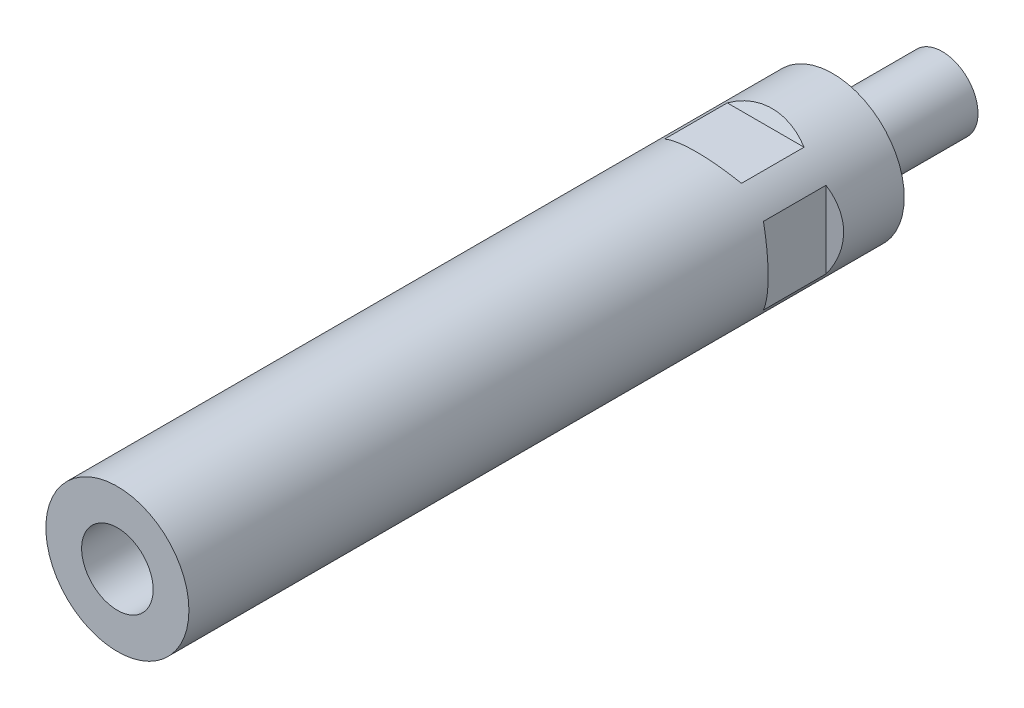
ISO-10303-21;
HEADER;
FILE_DESCRIPTION(('STEP AP214'),'2;1');
FILE_NAME('part.step','',(''),(''),'','','');
FILE_SCHEMA(('AUTOMOTIVE_DESIGN { 1 0 10303 214 1 1 1 1 }'));
ENDSEC;
DATA;
#1=APPLICATION_CONTEXT('core data for automotive mechanical design processes');
#2=APPLICATION_PROTOCOL_DEFINITION('international standard','automotive_design',2000,#1);
#3=PRODUCT_CONTEXT('',#1,'mechanical');
#4=PRODUCT('Part','Part','',(#3));
#5=PRODUCT_RELATED_PRODUCT_CATEGORY('part','',(#4));
#6=PRODUCT_DEFINITION_FORMATION('','',#4);
#7=PRODUCT_DEFINITION_CONTEXT('part definition',#1,'design');
#8=PRODUCT_DEFINITION('design','',#6,#7);
#9=PRODUCT_DEFINITION_SHAPE('','',#8);
#10=(LENGTH_UNIT() NAMED_UNIT(*) SI_UNIT(.MILLI.,.METRE.));
#11=(NAMED_UNIT(*) PLANE_ANGLE_UNIT() SI_UNIT($,.RADIAN.));
#12=(NAMED_UNIT(*) SI_UNIT($,.STERADIAN.) SOLID_ANGLE_UNIT());
#13=UNCERTAINTY_MEASURE_WITH_UNIT(LENGTH_MEASURE(1.E-05),#10,'distance_accuracy_value','');
#14=(GEOMETRIC_REPRESENTATION_CONTEXT(3) GLOBAL_UNCERTAINTY_ASSIGNED_CONTEXT((#13)) GLOBAL_UNIT_ASSIGNED_CONTEXT((#10,
#11,#12)) REPRESENTATION_CONTEXT('',''));
#15=CARTESIAN_POINT('',(0.,0.,0.));
#16=DIRECTION('',(0.,0.,1.));
#17=DIRECTION('',(1.,0.,0.));
#18=AXIS2_PLACEMENT_3D('',#15,#16,#17);
#19=CARTESIAN_POINT('',(0.,0.,-4.5));
#20=DIRECTION('',(0.,0.,1.));
#21=DIRECTION('',(0.,-1.,0.));
#22=AXIS2_PLACEMENT_3D('',#19,#20,#21);
#23=CYLINDRICAL_SURFACE('',#22,8.);
#24=CARTESIAN_POINT('',(0.,0.,-24.5));
#25=DIRECTION('',(0.,0.,1.));
#26=DIRECTION('',(0.,-1.,0.));
#27=AXIS2_PLACEMENT_3D('',#24,#25,#26);
#28=CIRCLE('',#27,8.);
#29=CARTESIAN_POINT('',(0.,-8.,-24.5));
#30=VERTEX_POINT('',#29);
#31=EDGE_CURVE('E22',#30,#30,#28,.F.);
#32=ORIENTED_EDGE('',*,*,#31,.F.);
#33=EDGE_LOOP('',(#32));
#34=FACE_BOUND('',#33,.T.);
#35=CARTESIAN_POINT('',(0.,0.,0.));
#36=DIRECTION('',(0.,0.,1.));
#37=DIRECTION('',(1.,0.,0.));
#38=AXIS2_PLACEMENT_3D('',#35,#36,#37);
#39=CIRCLE('',#38,8.);
#40=CARTESIAN_POINT('',(8.,0.,0.));
#41=VERTEX_POINT('',#40);
#42=EDGE_CURVE('E9',#41,#41,#39,.T.);
#43=ORIENTED_EDGE('',*,*,#42,.F.);
#44=EDGE_LOOP('',(#43));
#45=FACE_BOUND('',#44,.T.);
#46=ADVANCED_FACE('F14',(#34,#45),#23,.T.);
#47=CARTESIAN_POINT('',(0.,0.,-24.5));
#48=DIRECTION('',(0.,0.,1.));
#49=DIRECTION('',(0.,-1.,0.));
#50=AXIS2_PLACEMENT_3D('',#47,#48,#49);
#51=PLANE('',#50);
#52=ORIENTED_EDGE('',*,*,#31,.T.);
#53=EDGE_LOOP('',(#52));
#54=FACE_BOUND('',#53,.T.);
#55=ADVANCED_FACE('F16',(#54),#51,.F.);
#56=CARTESIAN_POINT('',(7.,0.,120.));
#57=DIRECTION('',(0.,0.,-1.));
#58=DIRECTION('',(-1.,0.,0.));
#59=AXIS2_PLACEMENT_3D('',#56,#57,#58);
#60=PLANE('',#59);
#61=CARTESIAN_POINT('',(0.,0.,120.));
#62=DIRECTION('',(0.,0.,1.));
#63=DIRECTION('',(1.,0.,0.));
#64=AXIS2_PLACEMENT_3D('',#61,#62,#63);
#65=CIRCLE('',#64,8.);
#66=CARTESIAN_POINT('',(8.,0.,120.));
#67=VERTEX_POINT('',#66);
#68=EDGE_CURVE('E251',#67,#67,#65,.T.);
#69=ORIENTED_EDGE('',*,*,#68,.T.);
#70=EDGE_LOOP('',(#69));
#71=FACE_BOUND('',#70,.T.);
#72=ADVANCED_FACE('F125',(#71),#60,.F.);
#73=CARTESIAN_POINT('',(0.,0.,160.));
#74=DIRECTION('',(0.,0.,1.));
#75=DIRECTION('',(1.,0.,0.));
#76=AXIS2_PLACEMENT_3D('',#73,#74,#75);
#77=CYLINDRICAL_SURFACE('',#76,8.);
#78=ORIENTED_EDGE('',*,*,#68,.F.);
#79=EDGE_LOOP('',(#78));
#80=FACE_BOUND('',#79,.T.);
#81=CARTESIAN_POINT('',(0.,0.,160.));
#82=DIRECTION('',(0.,0.,1.));
#83=DIRECTION('',(1.,0.,0.));
#84=AXIS2_PLACEMENT_3D('',#81,#82,#83);
#85=CIRCLE('',#84,8.);
#86=CARTESIAN_POINT('',(8.,0.,160.));
#87=VERTEX_POINT('',#86);
#88=EDGE_CURVE('E96',#87,#87,#85,.T.);
#89=ORIENTED_EDGE('',*,*,#88,.T.);
#90=EDGE_LOOP('',(#89));
#91=FACE_BOUND('',#90,.T.);
#92=ADVANCED_FACE('F127',(#80,#91),#77,.F.);
#93=CARTESIAN_POINT('',(0.,0.,160.));
#94=DIRECTION('',(0.,0.,1.));
#95=DIRECTION('',(1.,0.,0.));
#96=AXIS2_PLACEMENT_3D('',#93,#94,#95);
#97=PLANE('',#96);
#98=ORIENTED_EDGE('',*,*,#88,.F.);
#99=EDGE_LOOP('',(#98));
#100=FACE_BOUND('',#99,.T.);
#101=CARTESIAN_POINT('',(0.,0.,160.));
#102=DIRECTION('',(0.,0.,1.));
#103=DIRECTION('',(1.,0.,0.));
#104=AXIS2_PLACEMENT_3D('',#101,#102,#103);
#105=CIRCLE('',#104,16.);
#106=CARTESIAN_POINT('',(16.,0.,160.));
#107=VERTEX_POINT('',#106);
#108=EDGE_CURVE('E239',#107,#107,#105,.T.);
#109=ORIENTED_EDGE('',*,*,#108,.T.);
#110=EDGE_LOOP('',(#109));
#111=FACE_BOUND('',#110,.T.);
#112=ADVANCED_FACE('F134',(#100,#111),#97,.T.);
#113=CARTESIAN_POINT('',(13.5,-16.,29.));
#114=DIRECTION('',(-0.5,0.,0.866025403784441));
#115=DIRECTION('',(0.866025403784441,0.,0.5));
#116=AXIS2_PLACEMENT_3D('',#113,#114,#115);
#117=PLANE('',#116);
#118=DIRECTION('',(0.,1.,0.));
#119=VECTOR('',#118,1.);
#120=CARTESIAN_POINT('',(13.5,-16.,29.));
#121=LINE('',#120,#119);
#122=CARTESIAN_POINT('',(13.5,-8.58778201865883,29.));
#123=VERTEX_POINT('',#122);
#124=CARTESIAN_POINT('',(13.5,8.58778201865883,29.));
#125=VERTEX_POINT('',#124);
#126=EDGE_CURVE('E183',#123,#125,#121,.T.);
#127=ORIENTED_EDGE('',*,*,#126,.T.);
#128=CARTESIAN_POINT('',(0.,0.,21.2057713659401));
#129=DIRECTION('',(-0.5,0.,0.866025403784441));
#130=DIRECTION('',(-0.866025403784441,0.,-0.5));
#131=AXIS2_PLACEMENT_3D('',#128,#129,#130);
#132=ELLIPSE('',#131,18.475208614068,16.);
#133=EDGE_CURVE('E35',#123,#125,#132,.T.);
#134=ORIENTED_EDGE('',*,*,#133,.F.);
#135=EDGE_LOOP('',(#127,#134));
#136=FACE_BOUND('',#135,.T.);
#137=ADVANCED_FACE('F175',(#136),#117,.F.);
#138=CARTESIAN_POINT('',(13.5,-16.,29.));
#139=DIRECTION('',(-1.,0.,0.));
#140=DIRECTION('',(0.,0.,1.));
#141=AXIS2_PLACEMENT_3D('',#138,#139,#140);
#142=PLANE('',#141);
#143=ORIENTED_EDGE('',*,*,#126,.F.);
#144=DIRECTION('',(0.,0.,-1.));
#145=VECTOR('',#144,1.);
#146=CARTESIAN_POINT('',(13.5,-8.58778201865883,160.));
#147=LINE('',#146,#145);
#148=CARTESIAN_POINT('',(13.5,-8.58778201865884,15.));
#149=VERTEX_POINT('',#148);
#150=EDGE_CURVE('E191',#149,#123,#147,.F.);
#151=ORIENTED_EDGE('',*,*,#150,.F.);
#152=DIRECTION('',(0.,1.,0.));
#153=VECTOR('',#152,1.);
#154=CARTESIAN_POINT('',(13.5,-16.,15.));
#155=LINE('',#154,#153);
#156=CARTESIAN_POINT('',(13.5,8.58778201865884,15.));
#157=VERTEX_POINT('',#156);
#158=EDGE_CURVE('E187',#149,#157,#155,.T.);
#159=ORIENTED_EDGE('',*,*,#158,.T.);
#160=DIRECTION('',(0.,0.,-1.));
#161=VECTOR('',#160,1.);
#162=CARTESIAN_POINT('',(13.5,8.58778201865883,160.));
#163=LINE('',#162,#161);
#164=EDGE_CURVE('E29',#125,#157,#163,.T.);
#165=ORIENTED_EDGE('',*,*,#164,.F.);
#166=EDGE_LOOP('',(#143,#151,#159,#165));
#167=FACE_BOUND('',#166,.T.);
#168=ADVANCED_FACE('F172',(#167),#142,.F.);
#169=CARTESIAN_POINT('',(13.5,-16.,15.));
#170=DIRECTION('',(-0.5,0.,-0.866025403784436));
#171=DIRECTION('',(-0.866025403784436,0.,0.5));
#172=AXIS2_PLACEMENT_3D('',#169,#170,#171);
#173=PLANE('',#172);
#174=CARTESIAN_POINT('',(0.,0.,22.7942286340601));
#175=DIRECTION('',(-0.5,0.,-0.866025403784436));
#176=DIRECTION('',(0.866025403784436,0.,-0.5));
#177=AXIS2_PLACEMENT_3D('',#174,#175,#176);
#178=ELLIPSE('',#177,18.4752086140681,16.);
#179=EDGE_CURVE('E195',#157,#149,#178,.T.);
#180=ORIENTED_EDGE('',*,*,#179,.F.);
#181=ORIENTED_EDGE('',*,*,#158,.F.);
#182=EDGE_LOOP('',(#180,#181));
#183=FACE_BOUND('',#182,.T.);
#184=ADVANCED_FACE('F167',(#183),#173,.F.);
#185=CARTESIAN_POINT('',(-13.5,-16.,15.));
#186=DIRECTION('',(0.5,0.,-0.866025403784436));
#187=DIRECTION('',(-0.866025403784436,0.,-0.5));
#188=AXIS2_PLACEMENT_3D('',#185,#186,#187);
#189=PLANE('',#188);
#190=CARTESIAN_POINT('',(0.,0.,22.7942286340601));
#191=DIRECTION('',(0.5,0.,-0.866025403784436));
#192=DIRECTION('',(-0.866025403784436,0.,-0.5));
#193=AXIS2_PLACEMENT_3D('',#190,#191,#192);
#194=ELLIPSE('',#193,18.4752086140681,16.);
#195=CARTESIAN_POINT('',(-13.5,-8.58778201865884,15.));
#196=VERTEX_POINT('',#195);
#197=CARTESIAN_POINT('',(-13.5,8.58778201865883,15.));
#198=VERTEX_POINT('',#197);
#199=EDGE_CURVE('E193',#196,#198,#194,.T.);
#200=ORIENTED_EDGE('',*,*,#199,.F.);
#201=DIRECTION('',(0.,1.,0.));
#202=VECTOR('',#201,1.);
#203=CARTESIAN_POINT('',(-13.5,-16.,15.));
#204=LINE('',#203,#202);
#205=EDGE_CURVE('E227',#196,#198,#204,.T.);
#206=ORIENTED_EDGE('',*,*,#205,.T.);
#207=EDGE_LOOP('',(#200,#206));
#208=FACE_BOUND('',#207,.T.);
#209=ADVANCED_FACE('F163',(#208),#189,.F.);
#210=CARTESIAN_POINT('',(-13.5,-16.,29.));
#211=DIRECTION('',(0.5,0.,0.866025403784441));
#212=DIRECTION('',(0.866025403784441,0.,-0.5));
#213=AXIS2_PLACEMENT_3D('',#210,#211,#212);
#214=PLANE('',#213);
#215=DIRECTION('',(0.,1.,0.));
#216=VECTOR('',#215,1.);
#217=CARTESIAN_POINT('',(-13.5,-16.,29.));
#218=LINE('',#217,#216);
#219=CARTESIAN_POINT('',(-13.5,-8.58778201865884,29.));
#220=VERTEX_POINT('',#219);
#221=CARTESIAN_POINT('',(-13.5,8.58778201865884,29.));
#222=VERTEX_POINT('',#221);
#223=EDGE_CURVE('E231',#220,#222,#218,.T.);
#224=ORIENTED_EDGE('',*,*,#223,.F.);
#225=CARTESIAN_POINT('',(0.,0.,21.2057713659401));
#226=DIRECTION('',(0.5,0.,0.866025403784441));
#227=DIRECTION('',(0.866025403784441,0.,-0.5));
#228=AXIS2_PLACEMENT_3D('',#225,#226,#227);
#229=ELLIPSE('',#228,18.475208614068,16.);
#230=EDGE_CURVE('E206',#222,#220,#229,.T.);
#231=ORIENTED_EDGE('',*,*,#230,.F.);
#232=EDGE_LOOP('',(#224,#231));
#233=FACE_BOUND('',#232,.T.);
#234=ADVANCED_FACE('F160',(#233),#214,.F.);
#235=CARTESIAN_POINT('',(-13.5,-16.,29.));
#236=DIRECTION('',(1.,0.,0.));
#237=DIRECTION('',(0.,0.,-1.));
#238=AXIS2_PLACEMENT_3D('',#235,#236,#237);
#239=PLANE('',#238);
#240=ORIENTED_EDGE('',*,*,#223,.T.);
#241=DIRECTION('',(0.,0.,-1.));
#242=VECTOR('',#241,1.);
#243=CARTESIAN_POINT('',(-13.5,8.58778201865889,160.));
#244=LINE('',#243,#242);
#245=EDGE_CURVE('E200',#198,#222,#244,.F.);
#246=ORIENTED_EDGE('',*,*,#245,.F.);
#247=ORIENTED_EDGE('',*,*,#205,.F.);
#248=DIRECTION('',(0.,0.,-1.));
#249=VECTOR('',#248,1.);
#250=CARTESIAN_POINT('',(-13.5,-8.58778201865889,160.));
#251=LINE('',#250,#249);
#252=EDGE_CURVE('E203',#220,#196,#251,.T.);
#253=ORIENTED_EDGE('',*,*,#252,.F.);
#254=EDGE_LOOP('',(#240,#246,#247,#253));
#255=FACE_BOUND('',#254,.T.);
#256=ADVANCED_FACE('F158',(#255),#239,.F.);
#257=CARTESIAN_POINT('',(16.,13.5,29.));
#258=DIRECTION('',(0.,-0.5,0.866025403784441));
#259=DIRECTION('',(0.,-0.866025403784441,-0.5));
#260=AXIS2_PLACEMENT_3D('',#257,#258,#259);
#261=PLANE('',#260);
#262=DIRECTION('',(-1.,0.,0.));
#263=VECTOR('',#262,1.);
#264=CARTESIAN_POINT('',(16.,13.5,29.));
#265=LINE('',#264,#263);
#266=CARTESIAN_POINT('',(8.58778201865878,13.5,29.));
#267=VERTEX_POINT('',#266);
#268=CARTESIAN_POINT('',(-8.58778201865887,13.5,29.));
#269=VERTEX_POINT('',#268);
#270=EDGE_CURVE('E225',#267,#269,#265,.T.);
#271=ORIENTED_EDGE('',*,*,#270,.T.);
#272=CARTESIAN_POINT('',(0.,0.,21.2057713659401));
#273=DIRECTION('',(0.,-0.5,0.866025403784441));
#274=DIRECTION('',(0.,-0.866025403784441,-0.5));
#275=AXIS2_PLACEMENT_3D('',#272,#273,#274);
#276=ELLIPSE('',#275,18.475208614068,16.);
#277=EDGE_CURVE('E214',#267,#269,#276,.T.);
#278=ORIENTED_EDGE('',*,*,#277,.F.);
#279=EDGE_LOOP('',(#271,#278));
#280=FACE_BOUND('',#279,.T.);
#281=ADVANCED_FACE('F151',(#280),#261,.F.);
#282=CARTESIAN_POINT('',(16.,13.5,29.));
#283=DIRECTION('',(0.,-1.,0.));
#284=DIRECTION('',(1.,0.,0.));
#285=AXIS2_PLACEMENT_3D('',#282,#283,#284);
#286=PLANE('',#285);
#287=ORIENTED_EDGE('',*,*,#270,.F.);
#288=DIRECTION('',(0.,0.,-1.));
#289=VECTOR('',#288,1.);
#290=CARTESIAN_POINT('',(8.58778201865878,13.5,160.));
#291=LINE('',#290,#289);
#292=CARTESIAN_POINT('',(8.58778201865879,13.5,15.));
#293=VERTEX_POINT('',#292);
#294=EDGE_CURVE('E88',#293,#267,#291,.F.);
#295=ORIENTED_EDGE('',*,*,#294,.F.);
#296=DIRECTION('',(-1.,0.,0.));
#297=VECTOR('',#296,1.);
#298=CARTESIAN_POINT('',(16.,13.5,15.));
#299=LINE('',#298,#297);
#300=CARTESIAN_POINT('',(-8.58778201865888,13.5,15.));
#301=VERTEX_POINT('',#300);
#302=EDGE_CURVE('E223',#293,#301,#299,.T.);
#303=ORIENTED_EDGE('',*,*,#302,.T.);
#304=DIRECTION('',(0.,0.,-1.));
#305=VECTOR('',#304,1.);
#306=CARTESIAN_POINT('',(-8.58778201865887,13.5,160.));
#307=LINE('',#306,#305);
#308=EDGE_CURVE('E211',#269,#301,#307,.T.);
#309=ORIENTED_EDGE('',*,*,#308,.F.);
#310=EDGE_LOOP('',(#287,#295,#303,#309));
#311=FACE_BOUND('',#310,.T.);
#312=ADVANCED_FACE('F148',(#311),#286,.F.);
#313=CARTESIAN_POINT('',(16.,13.5,15.));
#314=DIRECTION('',(0.,-0.5,-0.866025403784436));
#315=DIRECTION('',(0.,0.866025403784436,-0.5));
#316=AXIS2_PLACEMENT_3D('',#313,#314,#315);
#317=PLANE('',#316);
#318=CARTESIAN_POINT('',(0.,0.,22.7942286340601));
#319=DIRECTION('',(0.,-0.5,-0.866025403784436));
#320=DIRECTION('',(0.,0.866025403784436,-0.5));
#321=AXIS2_PLACEMENT_3D('',#318,#319,#320);
#322=ELLIPSE('',#321,18.4752086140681,16.);
#323=EDGE_CURVE('E209',#301,#293,#322,.T.);
#324=ORIENTED_EDGE('',*,*,#323,.F.);
#325=ORIENTED_EDGE('',*,*,#302,.F.);
#326=EDGE_LOOP('',(#324,#325));
#327=FACE_BOUND('',#326,.T.);
#328=ADVANCED_FACE('F145',(#327),#317,.F.);
#329=CARTESIAN_POINT('',(16.,-13.5,15.));
#330=DIRECTION('',(0.,0.5,-0.866025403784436));
#331=DIRECTION('',(0.,0.866025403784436,0.5));
#332=AXIS2_PLACEMENT_3D('',#329,#330,#331);
#333=PLANE('',#332);
#334=CARTESIAN_POINT('',(0.,0.,22.7942286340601));
#335=DIRECTION('',(0.,0.5,-0.866025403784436));
#336=DIRECTION('',(0.,-0.866025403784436,-0.5));
#337=AXIS2_PLACEMENT_3D('',#334,#335,#336);
#338=ELLIPSE('',#337,18.4752086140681,16.);
#339=CARTESIAN_POINT('',(8.58778201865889,-13.5,15.));
#340=VERTEX_POINT('',#339);
#341=CARTESIAN_POINT('',(-8.58778201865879,-13.5,15.));
#342=VERTEX_POINT('',#341);
#343=EDGE_CURVE('E79',#340,#342,#338,.T.);
#344=ORIENTED_EDGE('',*,*,#343,.F.);
#345=DIRECTION('',(-1.,0.,0.));
#346=VECTOR('',#345,1.);
#347=CARTESIAN_POINT('',(16.,-13.5,15.));
#348=LINE('',#347,#346);
#349=EDGE_CURVE('E82',#340,#342,#348,.T.);
#350=ORIENTED_EDGE('',*,*,#349,.T.);
#351=EDGE_LOOP('',(#344,#350));
#352=FACE_BOUND('',#351,.T.);
#353=ADVANCED_FACE('F81',(#352),#333,.F.);
#354=CARTESIAN_POINT('',(16.,-13.5,29.));
#355=DIRECTION('',(0.,0.5,0.866025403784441));
#356=DIRECTION('',(0.,-0.866025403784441,0.5));
#357=AXIS2_PLACEMENT_3D('',#354,#355,#356);
#358=PLANE('',#357);
#359=DIRECTION('',(-1.,0.,0.));
#360=VECTOR('',#359,1.);
#361=CARTESIAN_POINT('',(16.,-13.5,29.));
#362=LINE('',#361,#360);
#363=CARTESIAN_POINT('',(8.58778201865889,-13.5,29.));
#364=VERTEX_POINT('',#363);
#365=CARTESIAN_POINT('',(-8.5877820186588,-13.5,29.));
#366=VERTEX_POINT('',#365);
#367=EDGE_CURVE('E95',#364,#366,#362,.T.);
#368=ORIENTED_EDGE('',*,*,#367,.F.);
#369=CARTESIAN_POINT('',(0.,0.,21.2057713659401));
#370=DIRECTION('',(0.,0.5,0.866025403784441));
#371=DIRECTION('',(0.,0.866025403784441,-0.5));
#372=AXIS2_PLACEMENT_3D('',#369,#370,#371);
#373=ELLIPSE('',#372,18.475208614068,16.);
#374=EDGE_CURVE('E101',#366,#364,#373,.T.);
#375=ORIENTED_EDGE('',*,*,#374,.F.);
#376=EDGE_LOOP('',(#368,#375));
#377=FACE_BOUND('',#376,.T.);
#378=ADVANCED_FACE('F139',(#377),#358,.F.);
#379=CARTESIAN_POINT('',(16.,-13.5,29.));
#380=DIRECTION('',(0.,1.,0.));
#381=DIRECTION('',(-1.,0.,0.));
#382=AXIS2_PLACEMENT_3D('',#379,#380,#381);
#383=PLANE('',#382);
#384=ORIENTED_EDGE('',*,*,#367,.T.);
#385=DIRECTION('',(0.,0.,-1.));
#386=VECTOR('',#385,1.);
#387=CARTESIAN_POINT('',(-8.58778201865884,-13.5,160.));
#388=LINE('',#387,#386);
#389=EDGE_CURVE('E87',#342,#366,#388,.F.);
#390=ORIENTED_EDGE('',*,*,#389,.F.);
#391=ORIENTED_EDGE('',*,*,#349,.F.);
#392=DIRECTION('',(0.,0.,-1.));
#393=VECTOR('',#392,1.);
#394=CARTESIAN_POINT('',(8.58778201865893,-13.5,160.));
#395=LINE('',#394,#393);
#396=EDGE_CURVE('E93',#364,#340,#395,.T.);
#397=ORIENTED_EDGE('',*,*,#396,.F.);
#398=EDGE_LOOP('',(#384,#390,#391,#397));
#399=FACE_BOUND('',#398,.T.);
#400=ADVANCED_FACE('F92',(#399),#383,.F.);
#401=CARTESIAN_POINT('',(0.,0.,160.));
#402=DIRECTION('',(0.,0.,-1.));
#403=DIRECTION('',(-1.,0.,0.));
#404=AXIS2_PLACEMENT_3D('',#401,#402,#403);
#405=CYLINDRICAL_SURFACE('',#404,16.);
#406=ORIENTED_EDGE('',*,*,#389,.T.);
#407=ORIENTED_EDGE('',*,*,#374,.T.);
#408=ORIENTED_EDGE('',*,*,#396,.T.);
#409=ORIENTED_EDGE('',*,*,#343,.T.);
#410=EDGE_LOOP('',(#406,#407,#408,#409));
#411=FACE_BOUND('',#410,.T.);
#412=ORIENTED_EDGE('',*,*,#323,.T.);
#413=ORIENTED_EDGE('',*,*,#294,.T.);
#414=ORIENTED_EDGE('',*,*,#277,.T.);
#415=ORIENTED_EDGE('',*,*,#308,.T.);
#416=EDGE_LOOP('',(#412,#413,#414,#415));
#417=FACE_BOUND('',#416,.T.);
#418=ORIENTED_EDGE('',*,*,#245,.T.);
#419=ORIENTED_EDGE('',*,*,#230,.T.);
#420=ORIENTED_EDGE('',*,*,#252,.T.);
#421=ORIENTED_EDGE('',*,*,#199,.T.);
#422=EDGE_LOOP('',(#418,#419,#420,#421));
#423=FACE_BOUND('',#422,.T.);
#424=ORIENTED_EDGE('',*,*,#179,.T.);
#425=ORIENTED_EDGE('',*,*,#150,.T.);
#426=ORIENTED_EDGE('',*,*,#133,.T.);
#427=ORIENTED_EDGE('',*,*,#164,.T.);
#428=EDGE_LOOP('',(#424,#425,#426,#427));
#429=FACE_BOUND('',#428,.T.);
#430=ORIENTED_EDGE('',*,*,#108,.F.);
#431=EDGE_LOOP('',(#430));
#432=FACE_BOUND('',#431,.T.);
#433=CARTESIAN_POINT('',(0.,0.,0.));
#434=DIRECTION('',(0.,0.,1.));
#435=DIRECTION('',(1.,0.,0.));
#436=AXIS2_PLACEMENT_3D('',#433,#434,#435);
#437=CIRCLE('',#436,16.);
#438=CARTESIAN_POINT('',(16.,0.,0.));
#439=VERTEX_POINT('',#438);
#440=EDGE_CURVE('E186',#439,#439,#437,.T.);
#441=ORIENTED_EDGE('',*,*,#440,.T.);
#442=EDGE_LOOP('',(#441));
#443=FACE_BOUND('',#442,.T.);
#444=ADVANCED_FACE('F99',(#411,#417,#423,#429,#432,#443),#405,.T.);
#445=CARTESIAN_POINT('',(0.,0.,0.));
#446=DIRECTION('',(0.,0.,1.));
#447=DIRECTION('',(1.,0.,0.));
#448=AXIS2_PLACEMENT_3D('',#445,#446,#447);
#449=PLANE('',#448);
#450=ORIENTED_EDGE('',*,*,#440,.F.);
#451=EDGE_LOOP('',(#450));
#452=FACE_BOUND('',#451,.T.);
#453=ORIENTED_EDGE('',*,*,#42,.T.);
#454=EDGE_LOOP('',(#453));
#455=FACE_BOUND('',#454,.T.);
#456=ADVANCED_FACE('F111',(#452,#455),#449,.F.);
#457=CLOSED_SHELL('',(#46,#55,#72,#92,#112,#137,#168,#184,#209,#234,#256,#281,#312,#328,#353,
#378,#400,#444,#456));
#458=MANIFOLD_SOLID_BREP('B1',#457);
#459=ADVANCED_BREP_SHAPE_REPRESENTATION('',(#18,#458),#14);
#460=SHAPE_DEFINITION_REPRESENTATION(#9,#459);
ENDSEC;
END-ISO-10303-21;
